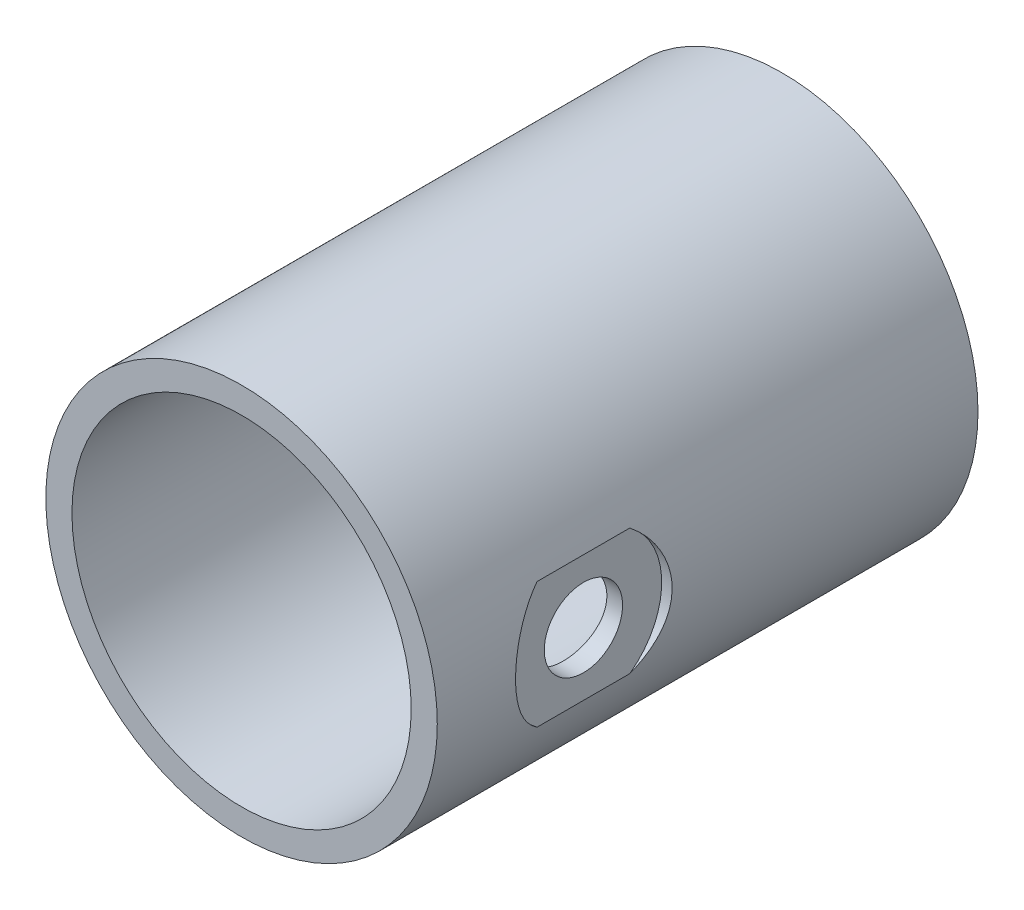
from build123d import *

# Parameters (mm, degrees)
SKETCH1_R          = 95.25
SKETCH1_R_2        = 82.55
BASE_EXTRUDE_DEPTH = 263.144
SKETCH3_R          = 38.1
CUT_EXTRUDE1_DEPTH = 5.08
SKETCH4_R          = 19.05
CUT_EXTRUDE2_DEPTH = 25.4


with BuildPart() as part:
    # Sketch1 → Base-Extrude (new body)
    with BuildSketch(Plane.XY):
        Circle(SKETCH1_R)
        Circle(SKETCH1_R_2, mode=Mode.SUBTRACT)
    extrude(amount=BASE_EXTRUDE_DEPTH)

    # Sketch3 → Cut-Extrude1 (cut)
    with BuildSketch(Plane(origin=(95.25, 0, 131.572), x_dir=(0, -1, 0), z_dir=(1, 0, 0))):
        with Locations((0, -55.372)):
            Circle(SKETCH3_R)
    extrude(amount=-CUT_EXTRUDE1_DEPTH, mode=Mode.SUBTRACT)

    # Sketch4 → Cut-Extrude2 (cut)
    with BuildSketch(Plane(origin=(90.17, 0, 0), x_dir=(0, 0, -1), z_dir=(1, 0, 0))):
        with Locations(Location((-186.944, 0, 0), (0, 0, 90))):
            Circle(SKETCH4_R)
    extrude(amount=-CUT_EXTRUDE2_DEPTH, mode=Mode.SUBTRACT)


solid = part.part
